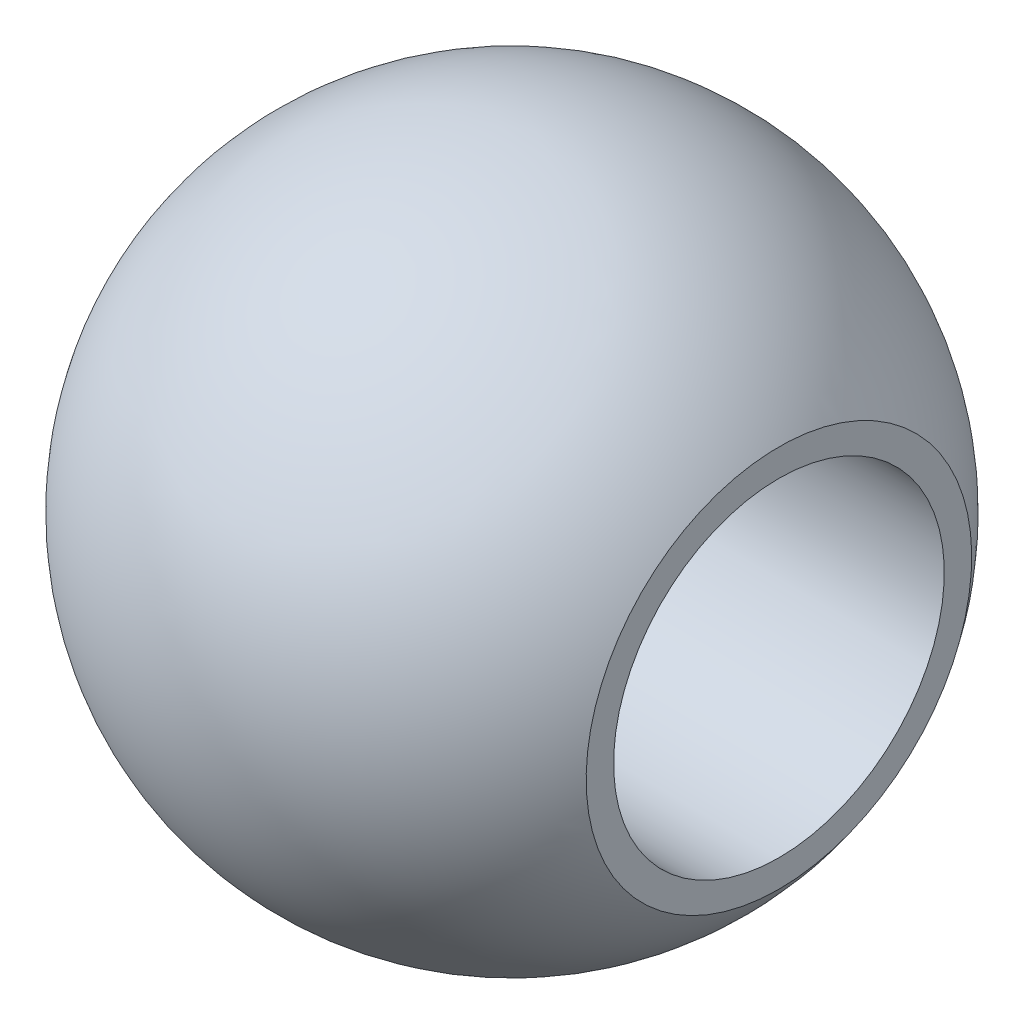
ISO-10303-21;
HEADER;
FILE_DESCRIPTION(('STEP AP214'),'2;1');
FILE_NAME('part.step','',(''),(''),'','','');
FILE_SCHEMA(('AUTOMOTIVE_DESIGN { 1 0 10303 214 1 1 1 1 }'));
ENDSEC;
DATA;
#1=APPLICATION_CONTEXT('core data for automotive mechanical design processes');
#2=APPLICATION_PROTOCOL_DEFINITION('international standard','automotive_design',2000,#1);
#3=PRODUCT_CONTEXT('',#1,'mechanical');
#4=PRODUCT('Part','Part','',(#3));
#5=PRODUCT_RELATED_PRODUCT_CATEGORY('part','',(#4));
#6=PRODUCT_DEFINITION_FORMATION('','',#4);
#7=PRODUCT_DEFINITION_CONTEXT('part definition',#1,'design');
#8=PRODUCT_DEFINITION('design','',#6,#7);
#9=PRODUCT_DEFINITION_SHAPE('','',#8);
#10=(LENGTH_UNIT() NAMED_UNIT(*) SI_UNIT(.MILLI.,.METRE.));
#11=(NAMED_UNIT(*) PLANE_ANGLE_UNIT() SI_UNIT($,.RADIAN.));
#12=(NAMED_UNIT(*) SI_UNIT($,.STERADIAN.) SOLID_ANGLE_UNIT());
#13=UNCERTAINTY_MEASURE_WITH_UNIT(LENGTH_MEASURE(1.E-05),#10,'distance_accuracy_value','');
#14=(GEOMETRIC_REPRESENTATION_CONTEXT(3) GLOBAL_UNCERTAINTY_ASSIGNED_CONTEXT((#13)) GLOBAL_UNIT_ASSIGNED_CONTEXT((#10,
#11,#12)) REPRESENTATION_CONTEXT('',''));
#15=CARTESIAN_POINT('',(0.,0.,0.));
#16=DIRECTION('',(0.,0.,1.));
#17=DIRECTION('',(1.,0.,0.));
#18=AXIS2_PLACEMENT_3D('',#15,#16,#17);
#19=CARTESIAN_POINT('',(0.,0.,0.));
#20=DIRECTION('',(0.,-1.,0.));
#21=DIRECTION('',(-1.,0.,0.));
#22=AXIS2_PLACEMENT_3D('',#19,#20,#21);
#23=SPHERICAL_SURFACE('',#22,8.);
#24=CARTESIAN_POINT('',(0.,0.,0.));
#25=DIRECTION('',(-0.999990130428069,0.0031415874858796,-0.00314157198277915));
#26=DIRECTION('',(-0.00314160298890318,-0.999995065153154,0.));
#27=AXIS2_PLACEMENT_3D('',#24,#25,#26);
#28=SPHERICAL_SURFACE('',#27,8.);
#29=CARTESIAN_POINT('',(6.49993584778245,-0.0204203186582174,0.0204202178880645));
#30=DIRECTION('',(-0.999990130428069,0.0031415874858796,-0.00314157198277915));
#31=DIRECTION('',(-0.00314160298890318,-0.999995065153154,0.));
#32=AXIS2_PLACEMENT_3D('',#29,#30,#31);
#33=CIRCLE('',#32,4.6636895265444);
#34=CARTESIAN_POINT('',(6.48528438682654,-4.68408683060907,0.0204202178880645));
#35=VERTEX_POINT('',#34);
#36=EDGE_CURVE('E10',#35,#35,#33,.F.);
#37=ORIENTED_EDGE('',*,*,#36,.F.);
#38=EDGE_LOOP('',(#37));
#39=FACE_BOUND('',#38,.T.);
#40=CARTESIAN_POINT('',(-6.49993584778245,0.0204203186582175,-0.0204202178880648));
#41=DIRECTION('',(-0.999990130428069,0.00314158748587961,-0.00314157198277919));
#42=DIRECTION('',(-0.00314160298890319,-0.999995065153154,0.));
#43=AXIS2_PLACEMENT_3D('',#40,#41,#42);
#44=CIRCLE('',#43,4.6636895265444);
#45=CARTESIAN_POINT('',(-6.51458730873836,-4.64324619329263,-0.0204202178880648));
#46=VERTEX_POINT('',#45);
#47=EDGE_CURVE('E41',#46,#46,#44,.F.);
#48=ORIENTED_EDGE('',*,*,#47,.T.);
#49=EDGE_LOOP('',(#48));
#50=FACE_BOUND('',#49,.T.);
#51=ADVANCED_FACE('F29',(#39,#50),#28,.T.);
#52=CARTESIAN_POINT('',(-8.05010686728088,0.0252903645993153,-0.0252902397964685));
#53=DIRECTION('',(0.999990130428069,-0.00314158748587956,0.00314157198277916));
#54=DIRECTION('',(0.00314160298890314,0.999995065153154,0.));
#55=AXIS2_PLACEMENT_3D('',#52,#53,#54);
#56=CYLINDRICAL_SURFACE('',#55,4.);
#57=CARTESIAN_POINT('',(6.49993584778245,-0.0204203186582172,0.0204202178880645));
#58=DIRECTION('',(-0.999990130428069,0.0031415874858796,-0.00314157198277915));
#59=DIRECTION('',(-0.00314160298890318,-0.999995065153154,0.));
#60=AXIS2_PLACEMENT_3D('',#57,#58,#59);
#61=CIRCLE('',#60,4.);
#62=CARTESIAN_POINT('',(6.48736943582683,-4.02040057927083,0.0204202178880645));
#63=VERTEX_POINT('',#62);
#64=EDGE_CURVE('E36',#63,#63,#61,.F.);
#65=ORIENTED_EDGE('',*,*,#64,.T.);
#66=EDGE_LOOP('',(#65));
#67=FACE_BOUND('',#66,.T.);
#68=CARTESIAN_POINT('',(-6.49993584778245,0.0204203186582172,-0.0204202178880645));
#69=DIRECTION('',(-0.999990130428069,0.00314158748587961,-0.00314157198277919));
#70=DIRECTION('',(-0.00314160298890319,-0.999995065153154,0.));
#71=AXIS2_PLACEMENT_3D('',#68,#69,#70);
#72=CIRCLE('',#71,4.);
#73=CARTESIAN_POINT('',(-6.51250225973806,-3.9795599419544,-0.0204202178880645));
#74=VERTEX_POINT('',#73);
#75=EDGE_CURVE('E32',#74,#74,#72,.F.);
#76=ORIENTED_EDGE('',*,*,#75,.F.);
#77=EDGE_LOOP('',(#76));
#78=FACE_BOUND('',#77,.T.);
#79=ADVANCED_FACE('F51',(#67,#78),#56,.F.);
#80=CARTESIAN_POINT('',(6.59067871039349,7.3045099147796,-21.5388686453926));
#81=DIRECTION('',(-0.999990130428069,0.0031415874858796,-0.00314157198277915));
#82=DIRECTION('',(-0.00314160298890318,-0.999995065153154,0.));
#83=AXIS2_PLACEMENT_3D('',#80,#81,#82);
#84=PLANE('',#83);
#85=ORIENTED_EDGE('',*,*,#36,.T.);
#86=EDGE_LOOP('',(#85));
#87=FACE_BOUND('',#86,.T.);
#88=ORIENTED_EDGE('',*,*,#64,.F.);
#89=EDGE_LOOP('',(#88));
#90=FACE_BOUND('',#89,.T.);
#91=ADVANCED_FACE('F53',(#87,#90),#84,.F.);
#92=CARTESIAN_POINT('',(-6.4312046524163,7.58669041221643,-14.3318597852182));
#93=DIRECTION('',(-0.999990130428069,0.00314158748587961,-0.00314157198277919));
#94=DIRECTION('',(-0.00314160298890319,-0.999995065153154,0.));
#95=AXIS2_PLACEMENT_3D('',#92,#93,#94);
#96=PLANE('',#95);
#97=ORIENTED_EDGE('',*,*,#47,.F.);
#98=EDGE_LOOP('',(#97));
#99=FACE_BOUND('',#98,.T.);
#100=ORIENTED_EDGE('',*,*,#75,.T.);
#101=EDGE_LOOP('',(#100));
#102=FACE_BOUND('',#101,.T.);
#103=ADVANCED_FACE('F49',(#99,#102),#96,.T.);
#104=CLOSED_SHELL('',(#51,#79,#91,#103));
#105=MANIFOLD_SOLID_BREP('B2',#104);
#106=ADVANCED_BREP_SHAPE_REPRESENTATION('',(#18,#105),#14);
#107=SHAPE_DEFINITION_REPRESENTATION(#9,#106);
ENDSEC;
END-ISO-10303-21;
